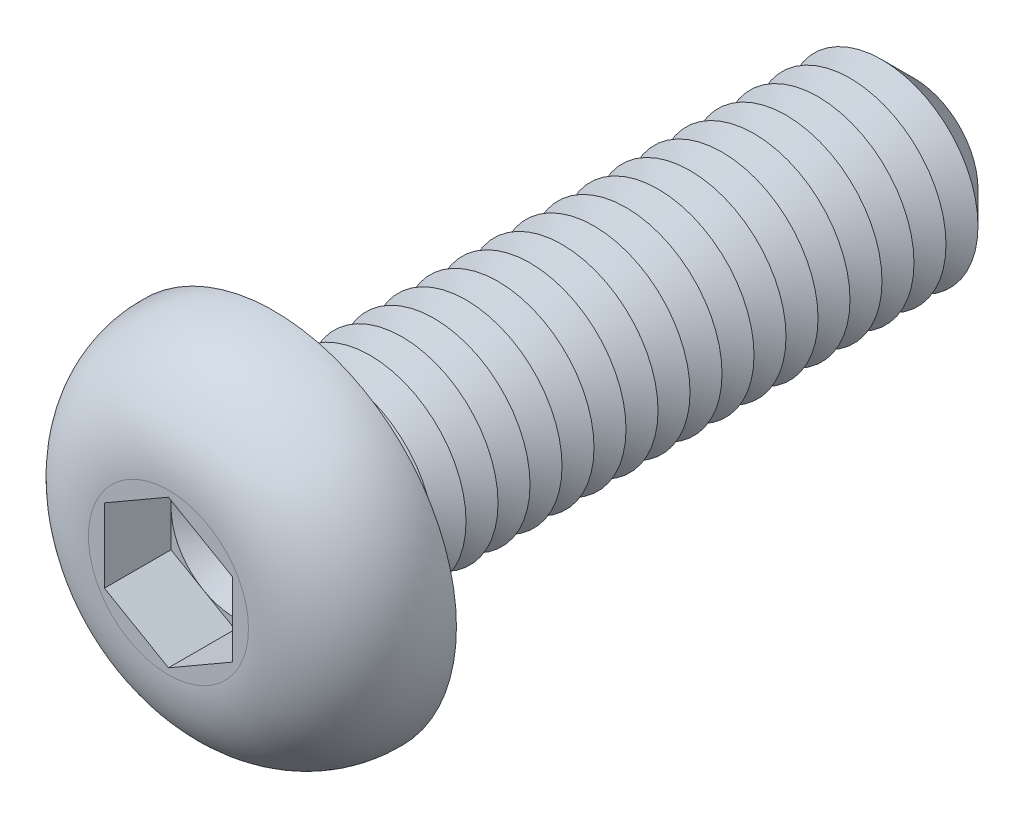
from build123d import *

# Parameters (mm, degrees)
CUT_EXTRUDE1_DEPTH  = 1.04
SKETCH4_R           = 1.5
BOSS_EXTRUDE1_DEPTH = 10
CHAMFER1_SIZE       = 0.5
LPATTERN1_COUNT     = 18
LPATTERN1_PITCH     = 0.5
FILLET2_R           = 0.2


with BuildPart() as part:
    # Sketch2 → Revolve1 (revolve)
    with BuildSketch(Plane(origin=(0, 0, 0), x_dir=(0, 0, -1), z_dir=(1, 0, 0)), mode=Mode.PRIVATE) as revolve1_sk:
        with BuildLine():
            Line((0, 0), (-1.65, 0))
            Line((-1.65, 0), (-1.65, 1.250781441))
            ThreePointArc((-1.65, 1.250781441), (-1.163552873, 2.39969397), (0, 2.85))
            Line((0, 2.85), (0, 0))
        make_face()
    revolve(revolve1_sk.sketch.rotate(Axis((0, 0, 47.934239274), (0, 0, -1)), 90), axis=Axis((0, 0, 47.934239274), (0, 0, -1)))

    # Sketch3 → Cut-Extrude1 (cut)
    with BuildSketch(Plane.XY.offset(1.65)):
        Polygon((0, 1.154700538), (-1, 0.577350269), (-1, -0.577350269), (0, -1.154700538), (1, -0.577350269), (1, 0.577350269), align=None)
    extrude(amount=-CUT_EXTRUDE1_DEPTH, mode=Mode.SUBTRACT)

    # Sketch4 → Boss-Extrude1 (add)
    with BuildSketch(Plane(origin=(0, 0, 0), x_dir=(-1, 0, 0), z_dir=(0, 0, -1))):
        with Locations(Location((0, 0, 0), (0, 0, 180))):
            Circle(SKETCH4_R)
    extrude(amount=BOSS_EXTRUDE1_DEPTH)

    # Chamfer1
    chamfer1_edges = [part.edges().sort_by_distance(p)[0] for p in [
        (-1.5, 0, -10),
    ]]
    chamfer(chamfer1_edges, length=CHAMFER1_SIZE)

    # Sketch5 → Cut-Revolve1 (revolve, cut)
    with BuildSketch(Plane(origin=(0, 0, 0), x_dir=(0, 0, -1), z_dir=(1, 0, 0)), mode=Mode.PRIVATE) as cut_revolve1_sk:
        Polygon((0.5, 1.5), (1, 1.5), (0.75, 1.066987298), align=None)
    cut_revolve1 = revolve(cut_revolve1_sk.sketch.rotate(Axis((0, 0, 47.934239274), (0, 0, -1)), 90), axis=Axis((0, 0, 47.934239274), (0, 0, -1)), mode=Mode.SUBTRACT)

    # LPattern1: Cut-Revolve1 ×18
    with Locations(*[(0, 0, -i * LPATTERN1_PITCH) for i in range(1, LPATTERN1_COUNT)]):
        add(cut_revolve1, mode=Mode.SUBTRACT)

    # Fillet2
    fillet2_edges = [part.edges().sort_by_distance(p)[0] for p in [
        (-1.5, 0, 0),
    ]]
    fillet(fillet2_edges, radius=FILLET2_R)

    # Cut-Extrude2 cone 1 section (on through the dimple's axis) → Cut-Extrude2 (revolve, cut)
    with BuildSketch(Plane(origin=(0, 0, 0.61), x_dir=(0, -1, 0), z_dir=(1, 0, 0))):
        Polygon((0, 0), (1, 0), (0, 0.577350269), align=None)
    revolve(axis=Axis((0, 0, 0.61), (0, 0, -1)), mode=Mode.SUBTRACT)


solid = part.part
